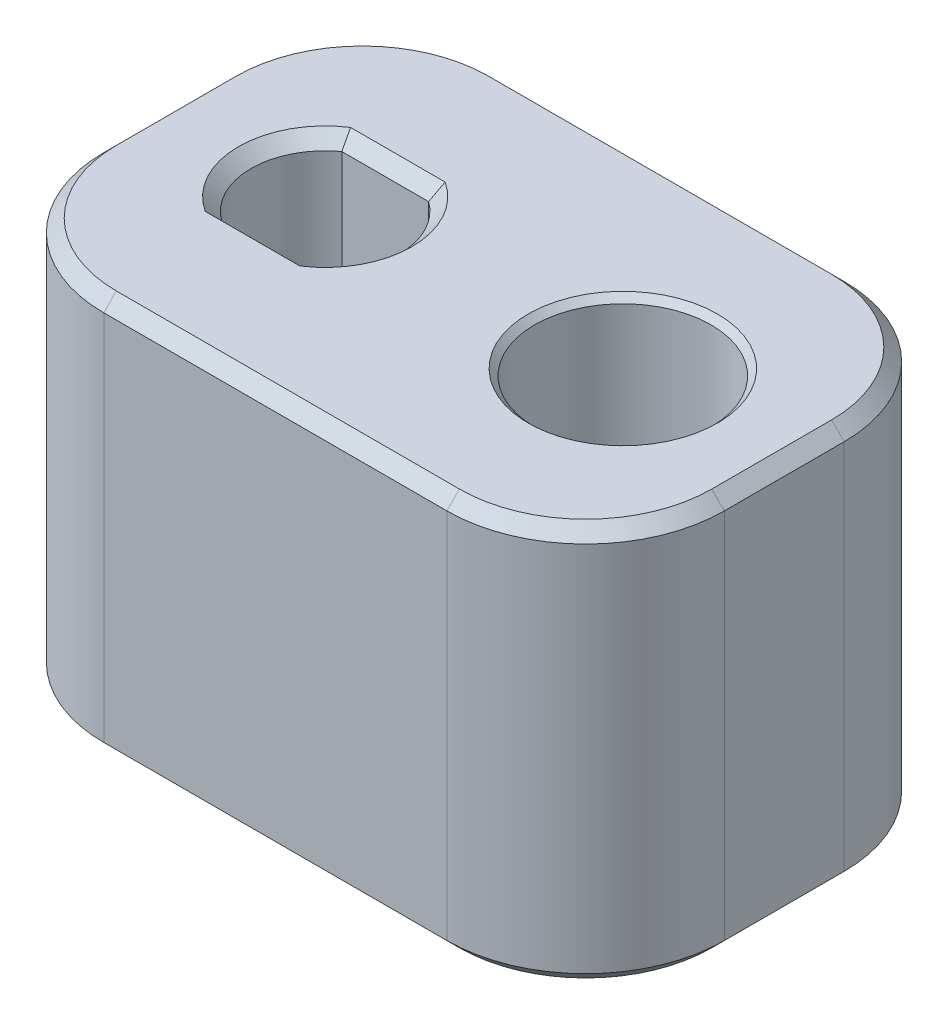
ISO-10303-21;
HEADER;
FILE_DESCRIPTION(('STEP AP214'),'2;1');
FILE_NAME('part.step','',(''),(''),'','','');
FILE_SCHEMA(('AUTOMOTIVE_DESIGN { 1 0 10303 214 1 1 1 1 }'));
ENDSEC;
DATA;
#1=APPLICATION_CONTEXT('core data for automotive mechanical design processes');
#2=APPLICATION_PROTOCOL_DEFINITION('international standard','automotive_design',2000,#1);
#3=PRODUCT_CONTEXT('',#1,'mechanical');
#4=PRODUCT('Part','Part','',(#3));
#5=PRODUCT_RELATED_PRODUCT_CATEGORY('part','',(#4));
#6=PRODUCT_DEFINITION_FORMATION('','',#4);
#7=PRODUCT_DEFINITION_CONTEXT('part definition',#1,'design');
#8=PRODUCT_DEFINITION('design','',#6,#7);
#9=PRODUCT_DEFINITION_SHAPE('','',#8);
#10=(LENGTH_UNIT() NAMED_UNIT(*) SI_UNIT(.MILLI.,.METRE.));
#11=(NAMED_UNIT(*) PLANE_ANGLE_UNIT() SI_UNIT($,.RADIAN.));
#12=(NAMED_UNIT(*) SI_UNIT($,.STERADIAN.) SOLID_ANGLE_UNIT());
#13=UNCERTAINTY_MEASURE_WITH_UNIT(LENGTH_MEASURE(1.E-05),#10,'distance_accuracy_value','');
#14=(GEOMETRIC_REPRESENTATION_CONTEXT(3) GLOBAL_UNCERTAINTY_ASSIGNED_CONTEXT((#13)) GLOBAL_UNIT_ASSIGNED_CONTEXT((#10,
#11,#12)) REPRESENTATION_CONTEXT('',''));
#15=CARTESIAN_POINT('',(0.,0.,0.));
#16=DIRECTION('',(0.,0.,1.));
#17=DIRECTION('',(1.,0.,0.));
#18=AXIS2_PLACEMENT_3D('',#15,#16,#17);
#19=CARTESIAN_POINT('',(12.4968,16.002,-8.001));
#20=DIRECTION('',(0.,-1.,0.));
#21=DIRECTION('',(0.,0.,-1.));
#22=AXIS2_PLACEMENT_3D('',#19,#20,#21);
#23=PLANE('',#22);
#24=CARTESIAN_POINT('',(6.9088,16.002,-2.413));
#25=DIRECTION('',(0.,-1.,0.));
#26=DIRECTION('',(0.,0.,-1.));
#27=AXIS2_PLACEMENT_3D('',#24,#25,#26);
#28=CIRCLE('',#27,5.08000000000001);
#29=CARTESIAN_POINT('',(11.9888,16.002,-2.413));
#30=VERTEX_POINT('',#29);
#31=CARTESIAN_POINT('',(6.9088,16.002,-7.493));
#32=VERTEX_POINT('',#31);
#33=EDGE_CURVE('E56',#30,#32,#28,.F.);
#34=ORIENTED_EDGE('',*,*,#33,.T.);
#35=DIRECTION('',(-1.,0.,0.));
#36=VECTOR('',#35,1.);
#37=CARTESIAN_POINT('',(12.4968,16.002,-7.493));
#38=LINE('',#37,#36);
#39=CARTESIAN_POINT('',(-6.9088,16.002,-7.493));
#40=VERTEX_POINT('',#39);
#41=EDGE_CURVE('E11',#32,#40,#38,.T.);
#42=ORIENTED_EDGE('',*,*,#41,.T.);
#43=CARTESIAN_POINT('',(-6.9088,16.002,-2.413));
#44=DIRECTION('',(0.,-1.,0.));
#45=DIRECTION('',(0.,0.,-1.));
#46=AXIS2_PLACEMENT_3D('',#43,#44,#45);
#47=CIRCLE('',#46,5.08000000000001);
#48=CARTESIAN_POINT('',(-11.9888,16.002,-2.413));
#49=VERTEX_POINT('',#48);
#50=EDGE_CURVE('E41',#40,#49,#47,.F.);
#51=ORIENTED_EDGE('',*,*,#50,.T.);
#52=DIRECTION('',(0.,0.,1.));
#53=VECTOR('',#52,1.);
#54=CARTESIAN_POINT('',(-11.9888,16.002,-8.001));
#55=LINE('',#54,#53);
#56=CARTESIAN_POINT('',(-11.9888,16.002,2.413));
#57=VERTEX_POINT('',#56);
#58=EDGE_CURVE('E402',#49,#57,#55,.T.);
#59=ORIENTED_EDGE('',*,*,#58,.T.);
#60=CARTESIAN_POINT('',(-6.9088,16.002,2.413));
#61=DIRECTION('',(0.,-1.,0.));
#62=DIRECTION('',(0.,0.,-1.));
#63=AXIS2_PLACEMENT_3D('',#60,#61,#62);
#64=CIRCLE('',#63,5.08000000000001);
#65=CARTESIAN_POINT('',(-6.9088,16.002,7.49300000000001));
#66=VERTEX_POINT('',#65);
#67=EDGE_CURVE('E398',#57,#66,#64,.F.);
#68=ORIENTED_EDGE('',*,*,#67,.T.);
#69=DIRECTION('',(1.,0.,0.));
#70=VECTOR('',#69,1.);
#71=CARTESIAN_POINT('',(12.4968,16.002,7.49300000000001));
#72=LINE('',#71,#70);
#73=CARTESIAN_POINT('',(6.9088,16.002,7.49300000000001));
#74=VERTEX_POINT('',#73);
#75=EDGE_CURVE('E394',#66,#74,#72,.T.);
#76=ORIENTED_EDGE('',*,*,#75,.T.);
#77=CARTESIAN_POINT('',(6.90879999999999,16.002,2.413));
#78=DIRECTION('',(0.,-1.,0.));
#79=DIRECTION('',(0.,0.,-1.));
#80=AXIS2_PLACEMENT_3D('',#77,#78,#79);
#81=CIRCLE('',#80,5.08000000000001);
#82=CARTESIAN_POINT('',(11.9888,16.002,2.413));
#83=VERTEX_POINT('',#82);
#84=EDGE_CURVE('E396',#74,#83,#81,.F.);
#85=ORIENTED_EDGE('',*,*,#84,.T.);
#86=DIRECTION('',(0.,0.,-1.));
#87=VECTOR('',#86,1.);
#88=CARTESIAN_POINT('',(11.9888,16.002,-8.001));
#89=LINE('',#88,#87);
#90=EDGE_CURVE('E400',#83,#30,#89,.T.);
#91=ORIENTED_EDGE('',*,*,#90,.T.);
#92=EDGE_LOOP('',(#34,#42,#51,#59,#68,#76,#85,#91));
#93=FACE_BOUND('',#92,.T.);
#94=DIRECTION('',(1.,0.,0.));
#95=VECTOR('',#94,1.);
#96=CARTESIAN_POINT('',(12.4968,16.002,-2.92735));
#97=LINE('',#96,#95);
#98=CARTESIAN_POINT('',(-7.8991777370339,16.002,-2.92735));
#99=VERTEX_POINT('',#98);
#100=CARTESIAN_POINT('',(-4.0896222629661,16.002,-2.92735));
#101=VERTEX_POINT('',#100);
#102=EDGE_CURVE('E237',#99,#101,#97,.T.);
#103=ORIENTED_EDGE('',*,*,#102,.T.);
#104=CARTESIAN_POINT('',(-5.9944,16.002,0.));
#105=DIRECTION('',(0.,-1.,0.));
#106=DIRECTION('',(0.,0.,-1.));
#107=AXIS2_PLACEMENT_3D('',#104,#105,#106);
#108=CIRCLE('',#107,3.4925);
#109=CARTESIAN_POINT('',(-4.08962226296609,16.002,2.92735));
#110=VERTEX_POINT('',#109);
#111=EDGE_CURVE('E249',#101,#110,#108,.T.);
#112=ORIENTED_EDGE('',*,*,#111,.T.);
#113=DIRECTION('',(-1.,0.,0.));
#114=VECTOR('',#113,1.);
#115=CARTESIAN_POINT('',(12.4968,16.002,2.92735));
#116=LINE('',#115,#114);
#117=CARTESIAN_POINT('',(-7.89917773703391,16.002,2.92735000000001));
#118=VERTEX_POINT('',#117);
#119=EDGE_CURVE('E247',#110,#118,#116,.T.);
#120=ORIENTED_EDGE('',*,*,#119,.T.);
#121=CARTESIAN_POINT('',(-5.9944,16.002,0.));
#122=DIRECTION('',(0.,-1.,0.));
#123=DIRECTION('',(0.,0.,-1.));
#124=AXIS2_PLACEMENT_3D('',#121,#122,#123);
#125=CIRCLE('',#124,3.49250000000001);
#126=EDGE_CURVE('E245',#118,#99,#125,.T.);
#127=ORIENTED_EDGE('',*,*,#126,.T.);
#128=EDGE_LOOP('',(#103,#112,#120,#127));
#129=FACE_BOUND('',#128,.T.);
#130=CARTESIAN_POINT('',(5.9944,16.002,0.));
#131=DIRECTION('',(0.,-1.,0.));
#132=DIRECTION('',(0.,0.,-1.));
#133=AXIS2_PLACEMENT_3D('',#130,#131,#132);
#134=CIRCLE('',#133,3.81);
#135=CARTESIAN_POINT('',(5.9944,16.002,-3.81));
#136=VERTEX_POINT('',#135);
#137=EDGE_CURVE('E493',#136,#136,#134,.T.);
#138=ORIENTED_EDGE('',*,*,#137,.T.);
#139=EDGE_LOOP('',(#138));
#140=FACE_BOUND('',#139,.T.);
#141=ADVANCED_FACE('F32',(#93,#129,#140),#23,.F.);
#142=CARTESIAN_POINT('',(12.4968,0.,-8.001));
#143=DIRECTION('',(0.,-1.,0.));
#144=DIRECTION('',(0.,0.,-1.));
#145=AXIS2_PLACEMENT_3D('',#142,#143,#144);
#146=PLANE('',#145);
#147=CARTESIAN_POINT('',(-6.9088,0.,-2.413));
#148=DIRECTION('',(0.,-1.,0.));
#149=DIRECTION('',(0.,0.,-1.));
#150=AXIS2_PLACEMENT_3D('',#147,#148,#149);
#151=CIRCLE('',#150,5.08);
#152=CARTESIAN_POINT('',(-11.9888,0.,-2.413));
#153=VERTEX_POINT('',#152);
#154=CARTESIAN_POINT('',(-6.9088,0.,-7.493));
#155=VERTEX_POINT('',#154);
#156=EDGE_CURVE('E361',#153,#155,#151,.T.);
#157=ORIENTED_EDGE('',*,*,#156,.T.);
#158=DIRECTION('',(1.,0.,0.));
#159=VECTOR('',#158,1.);
#160=CARTESIAN_POINT('',(6.9088,0.,-7.493));
#161=LINE('',#160,#159);
#162=CARTESIAN_POINT('',(6.9088,0.,-7.493));
#163=VERTEX_POINT('',#162);
#164=EDGE_CURVE('E363',#155,#163,#161,.T.);
#165=ORIENTED_EDGE('',*,*,#164,.T.);
#166=CARTESIAN_POINT('',(6.9088,0.,-2.413));
#167=DIRECTION('',(0.,-1.,0.));
#168=DIRECTION('',(0.,0.,-1.));
#169=AXIS2_PLACEMENT_3D('',#166,#167,#168);
#170=CIRCLE('',#169,5.08);
#171=CARTESIAN_POINT('',(11.9888,0.,-2.413));
#172=VERTEX_POINT('',#171);
#173=EDGE_CURVE('E359',#163,#172,#170,.T.);
#174=ORIENTED_EDGE('',*,*,#173,.T.);
#175=DIRECTION('',(0.,0.,1.));
#176=VECTOR('',#175,1.);
#177=CARTESIAN_POINT('',(11.9888,0.,2.413));
#178=LINE('',#177,#176);
#179=CARTESIAN_POINT('',(11.9888,0.,2.413));
#180=VERTEX_POINT('',#179);
#181=EDGE_CURVE('E355',#172,#180,#178,.T.);
#182=ORIENTED_EDGE('',*,*,#181,.T.);
#183=CARTESIAN_POINT('',(6.90879999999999,0.,2.413));
#184=DIRECTION('',(0.,-1.,0.));
#185=DIRECTION('',(0.,0.,-1.));
#186=AXIS2_PLACEMENT_3D('',#183,#184,#185);
#187=CIRCLE('',#186,5.08);
#188=CARTESIAN_POINT('',(6.9088,0.,7.493));
#189=VERTEX_POINT('',#188);
#190=EDGE_CURVE('E351',#180,#189,#187,.T.);
#191=ORIENTED_EDGE('',*,*,#190,.T.);
#192=DIRECTION('',(-1.,0.,0.));
#193=VECTOR('',#192,1.);
#194=CARTESIAN_POINT('',(-6.9088,0.,7.493));
#195=LINE('',#194,#193);
#196=CARTESIAN_POINT('',(-6.9088,0.,7.493));
#197=VERTEX_POINT('',#196);
#198=EDGE_CURVE('E349',#189,#197,#195,.T.);
#199=ORIENTED_EDGE('',*,*,#198,.T.);
#200=CARTESIAN_POINT('',(-6.9088,0.,2.413));
#201=DIRECTION('',(0.,-1.,0.));
#202=DIRECTION('',(0.,0.,-1.));
#203=AXIS2_PLACEMENT_3D('',#200,#201,#202);
#204=CIRCLE('',#203,5.08);
#205=CARTESIAN_POINT('',(-11.9888,0.,2.413));
#206=VERTEX_POINT('',#205);
#207=EDGE_CURVE('E353',#197,#206,#204,.T.);
#208=ORIENTED_EDGE('',*,*,#207,.T.);
#209=DIRECTION('',(0.,0.,-1.));
#210=VECTOR('',#209,1.);
#211=CARTESIAN_POINT('',(-11.9888,0.,-2.413));
#212=LINE('',#211,#210);
#213=EDGE_CURVE('E357',#206,#153,#212,.T.);
#214=ORIENTED_EDGE('',*,*,#213,.T.);
#215=EDGE_LOOP('',(#157,#165,#174,#182,#191,#199,#208,#214));
#216=FACE_BOUND('',#215,.T.);
#217=CARTESIAN_POINT('',(-5.9944,0.,0.));
#218=DIRECTION('',(0.,-1.,0.));
#219=DIRECTION('',(0.,0.,-1.));
#220=AXIS2_PLACEMENT_3D('',#217,#218,#219);
#221=CIRCLE('',#220,3.4925);
#222=CARTESIAN_POINT('',(-7.8991777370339,0.,-2.92735));
#223=VERTEX_POINT('',#222);
#224=CARTESIAN_POINT('',(-7.8991777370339,0.,2.92735));
#225=VERTEX_POINT('',#224);
#226=EDGE_CURVE('E262',#223,#225,#221,.F.);
#227=ORIENTED_EDGE('',*,*,#226,.T.);
#228=DIRECTION('',(1.,0.,0.));
#229=VECTOR('',#228,1.);
#230=CARTESIAN_POINT('',(-4.24683431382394,0.,2.92735));
#231=LINE('',#230,#229);
#232=CARTESIAN_POINT('',(-4.0896222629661,0.,2.92735));
#233=VERTEX_POINT('',#232);
#234=EDGE_CURVE('E266',#225,#233,#231,.T.);
#235=ORIENTED_EDGE('',*,*,#234,.T.);
#236=CARTESIAN_POINT('',(-5.9944,0.,0.));
#237=DIRECTION('',(0.,-1.,0.));
#238=DIRECTION('',(0.,0.,-1.));
#239=AXIS2_PLACEMENT_3D('',#236,#237,#238);
#240=CIRCLE('',#239,3.4925);
#241=CARTESIAN_POINT('',(-4.0896222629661,0.,-2.92735));
#242=VERTEX_POINT('',#241);
#243=EDGE_CURVE('E264',#233,#242,#240,.F.);
#244=ORIENTED_EDGE('',*,*,#243,.T.);
#245=DIRECTION('',(-1.,0.,0.));
#246=VECTOR('',#245,1.);
#247=CARTESIAN_POINT('',(-7.74196568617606,0.,-2.92735));
#248=LINE('',#247,#246);
#249=EDGE_CURVE('E226',#242,#223,#248,.T.);
#250=ORIENTED_EDGE('',*,*,#249,.T.);
#251=EDGE_LOOP('',(#227,#235,#244,#250));
#252=FACE_BOUND('',#251,.T.);
#253=CARTESIAN_POINT('',(5.9944,0.,0.));
#254=DIRECTION('',(0.,-1.,0.));
#255=DIRECTION('',(0.,0.,-1.));
#256=AXIS2_PLACEMENT_3D('',#253,#254,#255);
#257=CIRCLE('',#256,5.6642);
#258=CARTESIAN_POINT('',(5.9944,0.,-5.6642));
#259=VERTEX_POINT('',#258);
#260=EDGE_CURVE('E428',#259,#259,#257,.T.);
#261=ORIENTED_EDGE('',*,*,#260,.F.);
#262=EDGE_LOOP('',(#261));
#263=FACE_BOUND('',#262,.T.);
#264=ADVANCED_FACE('F514',(#216,#252,#263),#146,.T.);
#265=CARTESIAN_POINT('',(12.4968,16.002,8.001));
#266=DIRECTION('',(-1.,0.,0.));
#267=DIRECTION('',(0.,0.,1.));
#268=AXIS2_PLACEMENT_3D('',#265,#266,#267);
#269=PLANE('',#268);
#270=DIRECTION('',(0.,-1.,0.));
#271=VECTOR('',#270,1.);
#272=CARTESIAN_POINT('',(12.4968,16.002,2.413));
#273=LINE('',#272,#271);
#274=CARTESIAN_POINT('',(12.4968,15.494,2.413));
#275=VERTEX_POINT('',#274);
#276=CARTESIAN_POINT('',(12.4968,0.507999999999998,2.413));
#277=VERTEX_POINT('',#276);
#278=EDGE_CURVE('E240',#275,#277,#273,.T.);
#279=ORIENTED_EDGE('',*,*,#278,.T.);
#280=DIRECTION('',(0.,0.,-1.));
#281=VECTOR('',#280,1.);
#282=CARTESIAN_POINT('',(12.4968,0.507999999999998,-2.413));
#283=LINE('',#282,#281);
#284=CARTESIAN_POINT('',(12.4968,0.507999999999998,-2.413));
#285=VERTEX_POINT('',#284);
#286=EDGE_CURVE('E380',#277,#285,#283,.T.);
#287=ORIENTED_EDGE('',*,*,#286,.T.);
#288=DIRECTION('',(0.,-1.,0.));
#289=VECTOR('',#288,1.);
#290=CARTESIAN_POINT('',(12.4968,16.002,-2.413));
#291=LINE('',#290,#289);
#292=CARTESIAN_POINT('',(12.4968,15.494,-2.413));
#293=VERTEX_POINT('',#292);
#294=EDGE_CURVE('E235',#285,#293,#291,.F.);
#295=ORIENTED_EDGE('',*,*,#294,.T.);
#296=DIRECTION('',(0.,0.,1.));
#297=VECTOR('',#296,1.);
#298=CARTESIAN_POINT('',(12.4968,15.494,8.001));
#299=LINE('',#298,#297);
#300=EDGE_CURVE('E378',#293,#275,#299,.T.);
#301=ORIENTED_EDGE('',*,*,#300,.T.);
#302=EDGE_LOOP('',(#279,#287,#295,#301));
#303=FACE_BOUND('',#302,.T.);
#304=ADVANCED_FACE('F516',(#303),#269,.F.);
#305=CARTESIAN_POINT('',(-12.4968,16.002,-8.001));
#306=DIRECTION('',(0.,0.,1.));
#307=DIRECTION('',(1.,0.,0.));
#308=AXIS2_PLACEMENT_3D('',#305,#306,#307);
#309=PLANE('',#308);
#310=DIRECTION('',(0.,-1.,0.));
#311=VECTOR('',#310,1.);
#312=CARTESIAN_POINT('',(6.9088,16.002,-8.001));
#313=LINE('',#312,#311);
#314=CARTESIAN_POINT('',(6.9088,15.494,-8.001));
#315=VERTEX_POINT('',#314);
#316=CARTESIAN_POINT('',(6.9088,0.507999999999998,-8.001));
#317=VERTEX_POINT('',#316);
#318=EDGE_CURVE('E480',#315,#317,#313,.T.);
#319=ORIENTED_EDGE('',*,*,#318,.T.);
#320=DIRECTION('',(-1.,0.,0.));
#321=VECTOR('',#320,1.);
#322=CARTESIAN_POINT('',(-6.9088,0.507999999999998,-8.001));
#323=LINE('',#322,#321);
#324=CARTESIAN_POINT('',(-6.9088,0.507999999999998,-8.001));
#325=VERTEX_POINT('',#324);
#326=EDGE_CURVE('E346',#317,#325,#323,.T.);
#327=ORIENTED_EDGE('',*,*,#326,.T.);
#328=DIRECTION('',(0.,-1.,0.));
#329=VECTOR('',#328,1.);
#330=CARTESIAN_POINT('',(-6.9088,16.002,-8.001));
#331=LINE('',#330,#329);
#332=CARTESIAN_POINT('',(-6.9088,15.494,-8.001));
#333=VERTEX_POINT('',#332);
#334=EDGE_CURVE('E475',#325,#333,#331,.F.);
#335=ORIENTED_EDGE('',*,*,#334,.T.);
#336=DIRECTION('',(1.,0.,0.));
#337=VECTOR('',#336,1.);
#338=CARTESIAN_POINT('',(-12.4968,15.494,-8.001));
#339=LINE('',#338,#337);
#340=EDGE_CURVE('E269',#333,#315,#339,.T.);
#341=ORIENTED_EDGE('',*,*,#340,.T.);
#342=EDGE_LOOP('',(#319,#327,#335,#341));
#343=FACE_BOUND('',#342,.T.);
#344=ADVANCED_FACE('F523',(#343),#309,.F.);
#345=CARTESIAN_POINT('',(-12.4968,16.002,8.001));
#346=DIRECTION('',(1.,0.,0.));
#347=DIRECTION('',(0.,0.,-1.));
#348=AXIS2_PLACEMENT_3D('',#345,#346,#347);
#349=PLANE('',#348);
#350=DIRECTION('',(0.,-1.,0.));
#351=VECTOR('',#350,1.);
#352=CARTESIAN_POINT('',(-12.4968,16.002,-2.413));
#353=LINE('',#352,#351);
#354=CARTESIAN_POINT('',(-12.4968,15.494,-2.413));
#355=VERTEX_POINT('',#354);
#356=CARTESIAN_POINT('',(-12.4968,0.507999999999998,-2.413));
#357=VERTEX_POINT('',#356);
#358=EDGE_CURVE('E483',#355,#357,#353,.T.);
#359=ORIENTED_EDGE('',*,*,#358,.T.);
#360=DIRECTION('',(0.,0.,1.));
#361=VECTOR('',#360,1.);
#362=CARTESIAN_POINT('',(-12.4968,0.507999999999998,2.413));
#363=LINE('',#362,#361);
#364=CARTESIAN_POINT('',(-12.4968,0.507999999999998,2.413));
#365=VERTEX_POINT('',#364);
#366=EDGE_CURVE('E376',#357,#365,#363,.T.);
#367=ORIENTED_EDGE('',*,*,#366,.T.);
#368=DIRECTION('',(0.,-1.,0.));
#369=VECTOR('',#368,1.);
#370=CARTESIAN_POINT('',(-12.4968,16.002,2.413));
#371=LINE('',#370,#369);
#372=CARTESIAN_POINT('',(-12.4968,15.494,2.413));
#373=VERTEX_POINT('',#372);
#374=EDGE_CURVE('E486',#365,#373,#371,.F.);
#375=ORIENTED_EDGE('',*,*,#374,.T.);
#376=DIRECTION('',(0.,0.,-1.));
#377=VECTOR('',#376,1.);
#378=CARTESIAN_POINT('',(-12.4968,15.494,8.001));
#379=LINE('',#378,#377);
#380=EDGE_CURVE('E374',#373,#355,#379,.T.);
#381=ORIENTED_EDGE('',*,*,#380,.T.);
#382=EDGE_LOOP('',(#359,#367,#375,#381));
#383=FACE_BOUND('',#382,.T.);
#384=ADVANCED_FACE('F533',(#383),#349,.F.);
#385=CARTESIAN_POINT('',(-12.4968,16.002,8.001));
#386=DIRECTION('',(0.,0.,-1.));
#387=DIRECTION('',(-1.,0.,0.));
#388=AXIS2_PLACEMENT_3D('',#385,#386,#387);
#389=PLANE('',#388);
#390=DIRECTION('',(0.,-1.,0.));
#391=VECTOR('',#390,1.);
#392=CARTESIAN_POINT('',(-6.9088,16.002,8.001));
#393=LINE('',#392,#391);
#394=CARTESIAN_POINT('',(-6.9088,15.494,8.001));
#395=VERTEX_POINT('',#394);
#396=CARTESIAN_POINT('',(-6.9088,0.507999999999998,8.001));
#397=VERTEX_POINT('',#396);
#398=EDGE_CURVE('E464',#395,#397,#393,.T.);
#399=ORIENTED_EDGE('',*,*,#398,.T.);
#400=DIRECTION('',(1.,0.,0.));
#401=VECTOR('',#400,1.);
#402=CARTESIAN_POINT('',(6.9088,0.507999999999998,8.001));
#403=LINE('',#402,#401);
#404=CARTESIAN_POINT('',(6.9088,0.507999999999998,8.001));
#405=VERTEX_POINT('',#404);
#406=EDGE_CURVE('E392',#397,#405,#403,.T.);
#407=ORIENTED_EDGE('',*,*,#406,.T.);
#408=DIRECTION('',(0.,-1.,0.));
#409=VECTOR('',#408,1.);
#410=CARTESIAN_POINT('',(6.9088,16.002,8.001));
#411=LINE('',#410,#409);
#412=CARTESIAN_POINT('',(6.9088,15.494,8.001));
#413=VERTEX_POINT('',#412);
#414=EDGE_CURVE('E467',#405,#413,#411,.F.);
#415=ORIENTED_EDGE('',*,*,#414,.T.);
#416=DIRECTION('',(-1.,0.,0.));
#417=VECTOR('',#416,1.);
#418=CARTESIAN_POINT('',(-12.4968,15.494,8.001));
#419=LINE('',#418,#417);
#420=EDGE_CURVE('E390',#413,#395,#419,.T.);
#421=ORIENTED_EDGE('',*,*,#420,.T.);
#422=EDGE_LOOP('',(#399,#407,#415,#421));
#423=FACE_BOUND('',#422,.T.);
#424=ADVANCED_FACE('F463',(#423),#389,.F.);
#425=CARTESIAN_POINT('',(-6.9088,16.002,-2.413));
#426=DIRECTION('',(0.,-1.,0.));
#427=DIRECTION('',(0.,0.,-1.));
#428=AXIS2_PLACEMENT_3D('',#425,#426,#427);
#429=CYLINDRICAL_SURFACE('',#428,5.588);
#430=ORIENTED_EDGE('',*,*,#334,.F.);
#431=CARTESIAN_POINT('',(-6.9088,0.507999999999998,-2.413));
#432=DIRECTION('',(0.,-1.,0.));
#433=DIRECTION('',(0.,0.,-1.));
#434=AXIS2_PLACEMENT_3D('',#431,#432,#433);
#435=CIRCLE('',#434,5.588);
#436=EDGE_CURVE('E368',#325,#357,#435,.F.);
#437=ORIENTED_EDGE('',*,*,#436,.T.);
#438=ORIENTED_EDGE('',*,*,#358,.F.);
#439=CARTESIAN_POINT('',(-6.9088,15.494,-2.413));
#440=DIRECTION('',(0.,-1.,0.));
#441=DIRECTION('',(0.,0.,-1.));
#442=AXIS2_PLACEMENT_3D('',#439,#440,#441);
#443=CIRCLE('',#442,5.588);
#444=EDGE_CURVE('E366',#355,#333,#443,.T.);
#445=ORIENTED_EDGE('',*,*,#444,.T.);
#446=EDGE_LOOP('',(#430,#437,#438,#445));
#447=FACE_BOUND('',#446,.T.);
#448=ADVANCED_FACE('F532',(#447),#429,.T.);
#449=CARTESIAN_POINT('',(-6.9088,16.002,2.413));
#450=DIRECTION('',(0.,-1.,0.));
#451=DIRECTION('',(0.,0.,-1.));
#452=AXIS2_PLACEMENT_3D('',#449,#450,#451);
#453=CYLINDRICAL_SURFACE('',#452,5.588);
#454=ORIENTED_EDGE('',*,*,#374,.F.);
#455=CARTESIAN_POINT('',(-6.9088,0.507999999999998,2.413));
#456=DIRECTION('',(0.,-1.,0.));
#457=DIRECTION('',(0.,0.,-1.));
#458=AXIS2_PLACEMENT_3D('',#455,#456,#457);
#459=CIRCLE('',#458,5.588);
#460=EDGE_CURVE('E384',#365,#397,#459,.F.);
#461=ORIENTED_EDGE('',*,*,#460,.T.);
#462=ORIENTED_EDGE('',*,*,#398,.F.);
#463=CARTESIAN_POINT('',(-6.9088,15.494,2.413));
#464=DIRECTION('',(0.,-1.,0.));
#465=DIRECTION('',(0.,0.,-1.));
#466=AXIS2_PLACEMENT_3D('',#463,#464,#465);
#467=CIRCLE('',#466,5.588);
#468=EDGE_CURVE('E382',#395,#373,#467,.T.);
#469=ORIENTED_EDGE('',*,*,#468,.T.);
#470=EDGE_LOOP('',(#454,#461,#462,#469));
#471=FACE_BOUND('',#470,.T.);
#472=ADVANCED_FACE('F470',(#471),#453,.T.);
#473=CARTESIAN_POINT('',(6.9088,16.002,-2.413));
#474=DIRECTION('',(0.,-1.,0.));
#475=DIRECTION('',(0.,0.,-1.));
#476=AXIS2_PLACEMENT_3D('',#473,#474,#475);
#477=CYLINDRICAL_SURFACE('',#476,5.588);
#478=ORIENTED_EDGE('',*,*,#294,.F.);
#479=CARTESIAN_POINT('',(6.9088,0.507999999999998,-2.413));
#480=DIRECTION('',(0.,-1.,0.));
#481=DIRECTION('',(0.,0.,-1.));
#482=AXIS2_PLACEMENT_3D('',#479,#480,#481);
#483=CIRCLE('',#482,5.588);
#484=EDGE_CURVE('E372',#285,#317,#483,.F.);
#485=ORIENTED_EDGE('',*,*,#484,.T.);
#486=ORIENTED_EDGE('',*,*,#318,.F.);
#487=CARTESIAN_POINT('',(6.9088,15.494,-2.413));
#488=DIRECTION('',(0.,-1.,0.));
#489=DIRECTION('',(0.,0.,-1.));
#490=AXIS2_PLACEMENT_3D('',#487,#488,#489);
#491=CIRCLE('',#490,5.588);
#492=EDGE_CURVE('E370',#315,#293,#491,.T.);
#493=ORIENTED_EDGE('',*,*,#492,.T.);
#494=EDGE_LOOP('',(#478,#485,#486,#493));
#495=FACE_BOUND('',#494,.T.);
#496=ADVANCED_FACE('F545',(#495),#477,.T.);
#497=CARTESIAN_POINT('',(6.90879999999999,16.002,2.413));
#498=DIRECTION('',(0.,-1.,0.));
#499=DIRECTION('',(0.,0.,-1.));
#500=AXIS2_PLACEMENT_3D('',#497,#498,#499);
#501=CYLINDRICAL_SURFACE('',#500,5.588);
#502=ORIENTED_EDGE('',*,*,#414,.F.);
#503=CARTESIAN_POINT('',(6.90879999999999,0.507999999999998,2.413));
#504=DIRECTION('',(0.,-1.,0.));
#505=DIRECTION('',(0.,0.,-1.));
#506=AXIS2_PLACEMENT_3D('',#503,#504,#505);
#507=CIRCLE('',#506,5.588);
#508=EDGE_CURVE('E388',#405,#277,#507,.F.);
#509=ORIENTED_EDGE('',*,*,#508,.T.);
#510=ORIENTED_EDGE('',*,*,#278,.F.);
#511=CARTESIAN_POINT('',(6.90879999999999,15.494,2.413));
#512=DIRECTION('',(0.,-1.,0.));
#513=DIRECTION('',(0.,0.,-1.));
#514=AXIS2_PLACEMENT_3D('',#511,#512,#513);
#515=CIRCLE('',#514,5.588);
#516=EDGE_CURVE('E386',#275,#413,#515,.T.);
#517=ORIENTED_EDGE('',*,*,#516,.T.);
#518=EDGE_LOOP('',(#502,#509,#510,#517));
#519=FACE_BOUND('',#518,.T.);
#520=ADVANCED_FACE('F547',(#519),#501,.T.);
#521=CARTESIAN_POINT('',(-5.9944,0.,0.));
#522=DIRECTION('',(0.,1.,0.));
#523=DIRECTION('',(0.,0.,1.));
#524=AXIS2_PLACEMENT_3D('',#521,#522,#523);
#525=CYLINDRICAL_SURFACE('',#524,2.9845);
#526=DIRECTION('',(0.,1.,0.));
#527=VECTOR('',#526,1.);
#528=CARTESIAN_POINT('',(-7.74196568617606,0.,-2.41935));
#529=LINE('',#528,#527);
#530=CARTESIAN_POINT('',(-7.74196568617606,0.508000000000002,-2.41935));
#531=VERTEX_POINT('',#530);
#532=CARTESIAN_POINT('',(-7.74196568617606,15.494,-2.41935));
#533=VERTEX_POINT('',#532);
#534=EDGE_CURVE('E203',#531,#533,#529,.T.);
#535=ORIENTED_EDGE('',*,*,#534,.T.);
#536=CARTESIAN_POINT('',(-5.9944,15.494,0.));
#537=DIRECTION('',(0.,-1.,0.));
#538=DIRECTION('',(0.,0.,-1.));
#539=AXIS2_PLACEMENT_3D('',#536,#537,#538);
#540=CIRCLE('',#539,2.9845);
#541=CARTESIAN_POINT('',(-7.74196568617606,15.494,2.41935));
#542=VERTEX_POINT('',#541);
#543=EDGE_CURVE('E209',#533,#542,#540,.F.);
#544=ORIENTED_EDGE('',*,*,#543,.T.);
#545=DIRECTION('',(0.,1.,0.));
#546=VECTOR('',#545,1.);
#547=CARTESIAN_POINT('',(-7.74196568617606,0.,2.41935));
#548=LINE('',#547,#546);
#549=CARTESIAN_POINT('',(-7.74196568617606,0.508000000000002,2.41935));
#550=VERTEX_POINT('',#549);
#551=EDGE_CURVE('E488',#550,#542,#548,.T.);
#552=ORIENTED_EDGE('',*,*,#551,.F.);
#553=CARTESIAN_POINT('',(-5.9944,0.508000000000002,0.));
#554=DIRECTION('',(0.,-1.,0.));
#555=DIRECTION('',(0.,0.,-1.));
#556=AXIS2_PLACEMENT_3D('',#553,#554,#555);
#557=CIRCLE('',#556,2.9845);
#558=EDGE_CURVE('E257',#550,#531,#557,.T.);
#559=ORIENTED_EDGE('',*,*,#558,.T.);
#560=EDGE_LOOP('',(#535,#544,#552,#559));
#561=FACE_BOUND('',#560,.T.);
#562=ADVANCED_FACE('F550',(#561),#525,.F.);
#563=CARTESIAN_POINT('',(-7.74196568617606,0.,-2.41935));
#564=DIRECTION('',(0.,0.,-1.));
#565=DIRECTION('',(-1.,0.,0.));
#566=AXIS2_PLACEMENT_3D('',#563,#564,#565);
#567=PLANE('',#566);
#568=DIRECTION('',(0.,1.,0.));
#569=VECTOR('',#568,1.);
#570=CARTESIAN_POINT('',(-4.24683431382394,0.,-2.41935));
#571=LINE('',#570,#569);
#572=CARTESIAN_POINT('',(-4.24683431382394,0.508000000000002,-2.41935));
#573=VERTEX_POINT('',#572);
#574=CARTESIAN_POINT('',(-4.24683431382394,15.494,-2.41935));
#575=VERTEX_POINT('',#574);
#576=EDGE_CURVE('E201',#573,#575,#571,.T.);
#577=ORIENTED_EDGE('',*,*,#576,.T.);
#578=DIRECTION('',(-1.,0.,0.));
#579=VECTOR('',#578,1.);
#580=CARTESIAN_POINT('',(-7.74196568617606,15.494,-2.41935));
#581=LINE('',#580,#579);
#582=EDGE_CURVE('E208',#575,#533,#581,.T.);
#583=ORIENTED_EDGE('',*,*,#582,.T.);
#584=ORIENTED_EDGE('',*,*,#534,.F.);
#585=DIRECTION('',(1.,0.,0.));
#586=VECTOR('',#585,1.);
#587=CARTESIAN_POINT('',(-4.24683431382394,0.508000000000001,-2.41935));
#588=LINE('',#587,#586);
#589=EDGE_CURVE('E198',#531,#573,#588,.T.);
#590=ORIENTED_EDGE('',*,*,#589,.T.);
#591=EDGE_LOOP('',(#577,#583,#584,#590));
#592=FACE_BOUND('',#591,.T.);
#593=ADVANCED_FACE('F200',(#592),#567,.F.);
#594=CARTESIAN_POINT('',(-5.9944,0.,0.));
#595=DIRECTION('',(0.,1.,0.));
#596=DIRECTION('',(0.,0.,1.));
#597=AXIS2_PLACEMENT_3D('',#594,#595,#596);
#598=CYLINDRICAL_SURFACE('',#597,2.9845);
#599=DIRECTION('',(0.,1.,0.));
#600=VECTOR('',#599,1.);
#601=CARTESIAN_POINT('',(-4.24683431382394,0.,2.41935));
#602=LINE('',#601,#600);
#603=CARTESIAN_POINT('',(-4.24683431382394,0.508000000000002,2.41935));
#604=VERTEX_POINT('',#603);
#605=CARTESIAN_POINT('',(-4.24683431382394,15.494,2.41935));
#606=VERTEX_POINT('',#605);
#607=EDGE_CURVE('E220',#604,#606,#602,.T.);
#608=ORIENTED_EDGE('',*,*,#607,.T.);
#609=CARTESIAN_POINT('',(-5.9944,15.494,0.));
#610=DIRECTION('',(0.,-1.,0.));
#611=DIRECTION('',(0.,0.,-1.));
#612=AXIS2_PLACEMENT_3D('',#609,#610,#611);
#613=CIRCLE('',#612,2.9845);
#614=EDGE_CURVE('E219',#606,#575,#613,.F.);
#615=ORIENTED_EDGE('',*,*,#614,.T.);
#616=ORIENTED_EDGE('',*,*,#576,.F.);
#617=CARTESIAN_POINT('',(-5.9944,0.508000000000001,0.));
#618=DIRECTION('',(0.,-1.,0.));
#619=DIRECTION('',(0.,0.,-1.));
#620=AXIS2_PLACEMENT_3D('',#617,#618,#619);
#621=CIRCLE('',#620,2.9845);
#622=EDGE_CURVE('E216',#573,#604,#621,.T.);
#623=ORIENTED_EDGE('',*,*,#622,.T.);
#624=EDGE_LOOP('',(#608,#615,#616,#623));
#625=FACE_BOUND('',#624,.T.);
#626=ADVANCED_FACE('F214',(#625),#598,.F.);
#627=CARTESIAN_POINT('',(-7.74196568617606,0.,2.41935));
#628=DIRECTION('',(0.,0.,1.));
#629=DIRECTION('',(1.,0.,0.));
#630=AXIS2_PLACEMENT_3D('',#627,#628,#629);
#631=PLANE('',#630);
#632=ORIENTED_EDGE('',*,*,#551,.T.);
#633=DIRECTION('',(1.,0.,0.));
#634=VECTOR('',#633,1.);
#635=CARTESIAN_POINT('',(-7.74196568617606,15.494,2.41935));
#636=LINE('',#635,#634);
#637=EDGE_CURVE('E255',#542,#606,#636,.T.);
#638=ORIENTED_EDGE('',*,*,#637,.T.);
#639=ORIENTED_EDGE('',*,*,#607,.F.);
#640=DIRECTION('',(-1.,0.,0.));
#641=VECTOR('',#640,1.);
#642=CARTESIAN_POINT('',(-7.74196568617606,0.508000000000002,2.41935));
#643=LINE('',#642,#641);
#644=EDGE_CURVE('E252',#604,#550,#643,.T.);
#645=ORIENTED_EDGE('',*,*,#644,.T.);
#646=EDGE_LOOP('',(#632,#638,#639,#645));
#647=FACE_BOUND('',#646,.T.);
#648=ADVANCED_FACE('F309',(#647),#631,.F.);
#649=CARTESIAN_POINT('',(-5.9944,15.494,0.));
#650=DIRECTION('',(0.,1.,0.));
#651=DIRECTION('',(0.,0.,1.));
#652=AXIS2_PLACEMENT_3D('',#649,#650,#651);
#653=CONICAL_SURFACE('',#652,2.9845,0.785398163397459);
#654=CARTESIAN_POINT('',(-7.8991777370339,16.002,-2.92735));
#655=CARTESIAN_POINT('',(-7.87405161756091,15.917166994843,-2.84251699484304));
#656=CARTESIAN_POINT('',(-7.84838757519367,15.8324172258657,-2.75776722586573));
#657=CARTESIAN_POINT('',(-7.79598356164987,15.6630838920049,-2.58843389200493));
#658=CARTESIAN_POINT('',(-7.7692435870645,15.5785003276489,-2.50385032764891));
#659=CARTESIAN_POINT('',(-7.74196568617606,15.494,-2.41935));
#660=B_SPLINE_CURVE_WITH_KNOTS('',3,(#654,#655,#656,#657,#658,#659),.UNSPECIFIED.,.F.,.F.,(4,2,
4),(0.,0.367713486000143,0.735428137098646),.UNSPECIFIED.);
#661=EDGE_CURVE('E294',#99,#533,#660,.T.);
#662=ORIENTED_EDGE('',*,*,#661,.F.);
#663=ORIENTED_EDGE('',*,*,#126,.F.);
#664=CARTESIAN_POINT('',(-7.89917773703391,16.002,2.92735000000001));
#665=CARTESIAN_POINT('',(-7.87405161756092,15.917166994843,2.84251699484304));
#666=CARTESIAN_POINT('',(-7.84838757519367,15.8324172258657,2.75776722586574));
#667=CARTESIAN_POINT('',(-7.79598356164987,15.6630838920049,2.58843389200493));
#668=CARTESIAN_POINT('',(-7.7692435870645,15.5785003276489,2.50385032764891));
#669=CARTESIAN_POINT('',(-7.74196568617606,15.494,2.41935));
#670=B_SPLINE_CURVE_WITH_KNOTS('',3,(#664,#665,#666,#667,#668,#669),.UNSPECIFIED.,.F.,.F.,(4,2,
4),(0.,0.367713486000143,0.735428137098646),.UNSPECIFIED.);
#671=EDGE_CURVE('E300',#542,#118,#670,.F.);
#672=ORIENTED_EDGE('',*,*,#671,.F.);
#673=ORIENTED_EDGE('',*,*,#543,.F.);
#674=EDGE_LOOP('',(#662,#663,#672,#673));
#675=FACE_BOUND('',#674,.T.);
#676=ADVANCED_FACE('F305',(#675),#653,.F.);
#677=CARTESIAN_POINT('',(-7.74196568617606,15.494,2.41935));
#678=DIRECTION('',(0.,-0.707106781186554,0.707106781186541));
#679=DIRECTION('',(0.,-0.707106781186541,-0.707106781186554));
#680=AXIS2_PLACEMENT_3D('',#677,#678,#679);
#681=PLANE('',#680);
#682=ORIENTED_EDGE('',*,*,#671,.T.);
#683=ORIENTED_EDGE('',*,*,#119,.F.);
#684=CARTESIAN_POINT('',(-4.08962226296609,16.002,2.92735));
#685=CARTESIAN_POINT('',(-4.11474838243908,15.917166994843,2.84251699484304));
#686=CARTESIAN_POINT('',(-4.14041242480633,15.8324172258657,2.75776722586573));
#687=CARTESIAN_POINT('',(-4.19281643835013,15.6630838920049,2.58843389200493));
#688=CARTESIAN_POINT('',(-4.2195564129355,15.5785003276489,2.50385032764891));
#689=CARTESIAN_POINT('',(-4.24683431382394,15.494,2.41935));
#690=B_SPLINE_CURVE_WITH_KNOTS('',3,(#684,#685,#686,#687,#688,#689),.UNSPECIFIED.,.F.,.F.,(4,2,
4),(0.,0.367713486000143,0.735428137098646),.UNSPECIFIED.);
#691=EDGE_CURVE('E277',#606,#110,#690,.F.);
#692=ORIENTED_EDGE('',*,*,#691,.F.);
#693=ORIENTED_EDGE('',*,*,#637,.F.);
#694=EDGE_LOOP('',(#682,#683,#692,#693));
#695=FACE_BOUND('',#694,.T.);
#696=ADVANCED_FACE('F289',(#695),#681,.F.);
#697=CARTESIAN_POINT('',(-7.74196568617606,15.494,-2.41935));
#698=DIRECTION('',(0.,-0.707106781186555,-0.70710678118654));
#699=DIRECTION('',(0.,0.70710678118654,-0.707106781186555));
#700=AXIS2_PLACEMENT_3D('',#697,#698,#699);
#701=PLANE('',#700);
#702=ORIENTED_EDGE('',*,*,#661,.T.);
#703=ORIENTED_EDGE('',*,*,#582,.F.);
#704=CARTESIAN_POINT('',(-4.24683431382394,15.494,-2.41935));
#705=CARTESIAN_POINT('',(-4.2195564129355,15.5785003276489,-2.50385032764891));
#706=CARTESIAN_POINT('',(-4.19281643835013,15.6630838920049,-2.58843389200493));
#707=CARTESIAN_POINT('',(-4.14041242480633,15.8324172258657,-2.75776722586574));
#708=CARTESIAN_POINT('',(-4.11474838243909,15.917166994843,-2.84251699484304));
#709=CARTESIAN_POINT('',(-4.0896222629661,16.002,-2.92735000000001));
#710=B_SPLINE_CURVE_WITH_KNOTS('',3,(#704,#705,#706,#707,#708,#709),.UNSPECIFIED.,.F.,.F.,(4,2,
4),(0.,0.367714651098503,0.735428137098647),.UNSPECIFIED.);
#711=EDGE_CURVE('E270',#101,#575,#710,.F.);
#712=ORIENTED_EDGE('',*,*,#711,.F.);
#713=ORIENTED_EDGE('',*,*,#102,.F.);
#714=EDGE_LOOP('',(#702,#703,#712,#713));
#715=FACE_BOUND('',#714,.T.);
#716=ADVANCED_FACE('F286',(#715),#701,.F.);
#717=CARTESIAN_POINT('',(-5.9944,15.494,0.));
#718=DIRECTION('',(0.,1.,0.));
#719=DIRECTION('',(0.,0.,1.));
#720=AXIS2_PLACEMENT_3D('',#717,#718,#719);
#721=CONICAL_SURFACE('',#720,2.9845,0.785398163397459);
#722=ORIENTED_EDGE('',*,*,#691,.T.);
#723=ORIENTED_EDGE('',*,*,#111,.F.);
#724=ORIENTED_EDGE('',*,*,#711,.T.);
#725=ORIENTED_EDGE('',*,*,#614,.F.);
#726=EDGE_LOOP('',(#722,#723,#724,#725));
#727=FACE_BOUND('',#726,.T.);
#728=ADVANCED_FACE('F283',(#727),#721,.F.);
#729=CARTESIAN_POINT('',(12.4968,0.,-2.92735));
#730=DIRECTION('',(0.,-0.707106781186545,0.70710678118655));
#731=DIRECTION('',(0.,-0.70710678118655,-0.707106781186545));
#732=AXIS2_PLACEMENT_3D('',#729,#730,#731);
#733=PLANE('',#732);
#734=CARTESIAN_POINT('',(-4.0896222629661,0.,-2.92735));
#735=CARTESIAN_POINT('',(-4.11474838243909,0.084833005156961,-2.84251699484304));
#736=CARTESIAN_POINT('',(-4.14041242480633,0.169582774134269,-2.75776722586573));
#737=CARTESIAN_POINT('',(-4.19281643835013,0.338916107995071,-2.58843389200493));
#738=CARTESIAN_POINT('',(-4.2195564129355,0.423499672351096,-2.5038503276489));
#739=CARTESIAN_POINT('',(-4.24683431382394,0.508000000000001,-2.41935));
#740=B_SPLINE_CURVE_WITH_KNOTS('',3,(#734,#735,#736,#737,#738,#739),.UNSPECIFIED.,.F.,.F.,(4,2,
4),(0.,0.367713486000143,0.735428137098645),.UNSPECIFIED.);
#741=EDGE_CURVE('E224',#573,#242,#740,.F.);
#742=ORIENTED_EDGE('',*,*,#741,.F.);
#743=ORIENTED_EDGE('',*,*,#589,.F.);
#744=CARTESIAN_POINT('',(-7.74196568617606,0.508000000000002,-2.41935));
#745=CARTESIAN_POINT('',(-7.7692435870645,0.423499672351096,-2.5038503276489));
#746=CARTESIAN_POINT('',(-7.79598356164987,0.338916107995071,-2.58843389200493));
#747=CARTESIAN_POINT('',(-7.84838757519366,0.169582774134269,-2.75776722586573));
#748=CARTESIAN_POINT('',(-7.87405161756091,0.084833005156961,-2.84251699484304));
#749=CARTESIAN_POINT('',(-7.8991777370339,0.,-2.92735));
#750=B_SPLINE_CURVE_WITH_KNOTS('',3,(#744,#745,#746,#747,#748,#749),.UNSPECIFIED.,.F.,.F.,(4,2,
4),(0.,0.367714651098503,0.735428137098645),.UNSPECIFIED.);
#751=EDGE_CURVE('E229',#223,#531,#750,.F.);
#752=ORIENTED_EDGE('',*,*,#751,.F.);
#753=ORIENTED_EDGE('',*,*,#249,.F.);
#754=EDGE_LOOP('',(#742,#743,#752,#753));
#755=FACE_BOUND('',#754,.T.);
#756=ADVANCED_FACE('F225',(#755),#733,.T.);
#757=CARTESIAN_POINT('',(-5.9944,0.,0.));
#758=DIRECTION('',(0.,-1.,0.));
#759=DIRECTION('',(0.,0.,-1.));
#760=AXIS2_PLACEMENT_3D('',#757,#758,#759);
#761=CONICAL_SURFACE('',#760,3.4925,0.785398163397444);
#762=ORIENTED_EDGE('',*,*,#751,.T.);
#763=ORIENTED_EDGE('',*,*,#558,.F.);
#764=CARTESIAN_POINT('',(-7.74196568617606,0.508000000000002,2.41935));
#765=CARTESIAN_POINT('',(-7.7692435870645,0.423499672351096,2.50385032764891));
#766=CARTESIAN_POINT('',(-7.79598356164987,0.338916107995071,2.58843389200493));
#767=CARTESIAN_POINT('',(-7.84838757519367,0.16958277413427,2.75776722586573));
#768=CARTESIAN_POINT('',(-7.87405161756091,0.0848330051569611,2.84251699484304));
#769=CARTESIAN_POINT('',(-7.8991777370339,0.,2.92735));
#770=B_SPLINE_CURVE_WITH_KNOTS('',3,(#764,#765,#766,#767,#768,#769),.UNSPECIFIED.,.F.,.F.,(4,2,
4),(0.,0.367714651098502,0.735428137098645),.UNSPECIFIED.);
#771=EDGE_CURVE('E230',#225,#550,#770,.F.);
#772=ORIENTED_EDGE('',*,*,#771,.F.);
#773=ORIENTED_EDGE('',*,*,#226,.F.);
#774=EDGE_LOOP('',(#762,#763,#772,#773));
#775=FACE_BOUND('',#774,.T.);
#776=ADVANCED_FACE('F333',(#775),#761,.F.);
#777=CARTESIAN_POINT('',(-5.9944,0.,0.));
#778=DIRECTION('',(0.,-1.,0.));
#779=DIRECTION('',(0.,0.,-1.));
#780=AXIS2_PLACEMENT_3D('',#777,#778,#779);
#781=CONICAL_SURFACE('',#780,3.4925,0.785398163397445);
#782=ORIENTED_EDGE('',*,*,#741,.T.);
#783=ORIENTED_EDGE('',*,*,#243,.F.);
#784=CARTESIAN_POINT('',(-4.0896222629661,0.,2.92735));
#785=CARTESIAN_POINT('',(-4.11474838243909,0.0848330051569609,2.84251699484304));
#786=CARTESIAN_POINT('',(-4.14041242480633,0.169582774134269,2.75776722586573));
#787=CARTESIAN_POINT('',(-4.19281643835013,0.338916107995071,2.58843389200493));
#788=CARTESIAN_POINT('',(-4.2195564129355,0.423499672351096,2.50385032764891));
#789=CARTESIAN_POINT('',(-4.24683431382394,0.508000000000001,2.41935));
#790=B_SPLINE_CURVE_WITH_KNOTS('',3,(#784,#785,#786,#787,#788,#789),.UNSPECIFIED.,.F.,.F.,(4,2,
4),(0.,0.367713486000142,0.735428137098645),.UNSPECIFIED.);
#791=EDGE_CURVE('E234',#604,#233,#790,.F.);
#792=ORIENTED_EDGE('',*,*,#791,.F.);
#793=ORIENTED_EDGE('',*,*,#622,.F.);
#794=EDGE_LOOP('',(#782,#783,#792,#793));
#795=FACE_BOUND('',#794,.T.);
#796=ADVANCED_FACE('F233',(#795),#781,.F.);
#797=CARTESIAN_POINT('',(12.4968,0.,2.92734999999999));
#798=DIRECTION('',(0.,-0.707106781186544,-0.707106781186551));
#799=DIRECTION('',(0.,0.707106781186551,-0.707106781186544));
#800=AXIS2_PLACEMENT_3D('',#797,#798,#799);
#801=PLANE('',#800);
#802=ORIENTED_EDGE('',*,*,#771,.T.);
#803=ORIENTED_EDGE('',*,*,#644,.F.);
#804=ORIENTED_EDGE('',*,*,#791,.T.);
#805=ORIENTED_EDGE('',*,*,#234,.F.);
#806=EDGE_LOOP('',(#802,#803,#804,#805));
#807=FACE_BOUND('',#806,.T.);
#808=ADVANCED_FACE('F311',(#807),#801,.T.);
#809=CARTESIAN_POINT('',(5.9944,16.002,0.));
#810=DIRECTION('',(0.,1.,0.));
#811=DIRECTION('',(0.,0.,1.));
#812=AXIS2_PLACEMENT_3D('',#809,#810,#811);
#813=CONICAL_SURFACE('',#812,3.81,0.785398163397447);
#814=CARTESIAN_POINT('',(5.9944,15.748,0.));
#815=DIRECTION('',(0.,-1.,0.));
#816=DIRECTION('',(0.,0.,-1.));
#817=AXIS2_PLACEMENT_3D('',#814,#815,#816);
#818=CIRCLE('',#817,3.556);
#819=CARTESIAN_POINT('',(5.9944,15.748,-3.556));
#820=VERTEX_POINT('',#819);
#821=EDGE_CURVE('E496',#820,#820,#818,.T.);
#822=ORIENTED_EDGE('',*,*,#821,.T.);
#823=EDGE_LOOP('',(#822));
#824=FACE_BOUND('',#823,.T.);
#825=ORIENTED_EDGE('',*,*,#137,.F.);
#826=EDGE_LOOP('',(#825));
#827=FACE_BOUND('',#826,.T.);
#828=ADVANCED_FACE('F316',(#824,#827),#813,.F.);
#829=CARTESIAN_POINT('',(5.9944,-4.12040578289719,0.));
#830=DIRECTION('',(0.,-1.,0.));
#831=DIRECTION('',(0.,0.,-1.));
#832=AXIS2_PLACEMENT_3D('',#829,#830,#831);
#833=CYLINDRICAL_SURFACE('',#832,3.556);
#834=CARTESIAN_POINT('',(5.9944,7.112,0.));
#835=DIRECTION('',(0.,-1.,0.));
#836=DIRECTION('',(0.,0.,-1.));
#837=AXIS2_PLACEMENT_3D('',#834,#835,#836);
#838=CIRCLE('',#837,3.556);
#839=CARTESIAN_POINT('',(5.9944,7.112,-3.556));
#840=VERTEX_POINT('',#839);
#841=EDGE_CURVE('E499',#840,#840,#838,.T.);
#842=ORIENTED_EDGE('',*,*,#841,.T.);
#843=EDGE_LOOP('',(#842));
#844=FACE_BOUND('',#843,.T.);
#845=ORIENTED_EDGE('',*,*,#821,.F.);
#846=EDGE_LOOP('',(#845));
#847=FACE_BOUND('',#846,.T.);
#848=ADVANCED_FACE('F595',(#844,#847),#833,.F.);
#849=CARTESIAN_POINT('',(2.4384,7.112,0.));
#850=DIRECTION('',(0.,-1.,0.));
#851=DIRECTION('',(0.,0.,-1.));
#852=AXIS2_PLACEMENT_3D('',#849,#850,#851);
#853=PLANE('',#852);
#854=CARTESIAN_POINT('',(5.9944,7.112,0.));
#855=DIRECTION('',(0.,-1.,0.));
#856=DIRECTION('',(0.,0.,-1.));
#857=AXIS2_PLACEMENT_3D('',#854,#855,#856);
#858=CIRCLE('',#857,5.1562);
#859=CARTESIAN_POINT('',(5.9944,7.112,-5.1562));
#860=VERTEX_POINT('',#859);
#861=EDGE_CURVE('E502',#860,#860,#858,.T.);
#862=ORIENTED_EDGE('',*,*,#861,.T.);
#863=EDGE_LOOP('',(#862));
#864=FACE_BOUND('',#863,.T.);
#865=ORIENTED_EDGE('',*,*,#841,.F.);
#866=EDGE_LOOP('',(#865));
#867=FACE_BOUND('',#866,.T.);
#868=ADVANCED_FACE('F601',(#864,#867),#853,.T.);
#869=CARTESIAN_POINT('',(5.9944,-4.12040578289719,0.));
#870=DIRECTION('',(0.,-1.,0.));
#871=DIRECTION('',(0.,0.,-1.));
#872=AXIS2_PLACEMENT_3D('',#869,#870,#871);
#873=CYLINDRICAL_SURFACE('',#872,5.1562);
#874=CARTESIAN_POINT('',(5.9944,0.507999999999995,0.));
#875=DIRECTION('',(0.,-1.,0.));
#876=DIRECTION('',(0.,0.,-1.));
#877=AXIS2_PLACEMENT_3D('',#874,#875,#876);
#878=CIRCLE('',#877,5.1562);
#879=CARTESIAN_POINT('',(5.9944,0.507999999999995,-5.1562));
#880=VERTEX_POINT('',#879);
#881=EDGE_CURVE('E505',#880,#880,#878,.T.);
#882=ORIENTED_EDGE('',*,*,#881,.T.);
#883=EDGE_LOOP('',(#882));
#884=FACE_BOUND('',#883,.T.);
#885=ORIENTED_EDGE('',*,*,#861,.F.);
#886=EDGE_LOOP('',(#885));
#887=FACE_BOUND('',#886,.T.);
#888=ADVANCED_FACE('F672',(#884,#887),#873,.F.);
#889=CARTESIAN_POINT('',(5.9944,0.507999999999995,0.));
#890=DIRECTION('',(0.,-1.,0.));
#891=DIRECTION('',(0.,0.,-1.));
#892=AXIS2_PLACEMENT_3D('',#889,#890,#891);
#893=CONICAL_SURFACE('',#892,5.1562,0.785398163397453);
#894=ORIENTED_EDGE('',*,*,#260,.T.);
#895=EDGE_LOOP('',(#894));
#896=FACE_BOUND('',#895,.T.);
#897=ORIENTED_EDGE('',*,*,#881,.F.);
#898=EDGE_LOOP('',(#897));
#899=FACE_BOUND('',#898,.T.);
#900=ADVANCED_FACE('F511',(#896,#899),#893,.F.);
#901=CARTESIAN_POINT('',(-12.4968,0.507999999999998,8.001));
#902=DIRECTION('',(0.,-0.70710678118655,0.707106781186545));
#903=DIRECTION('',(0.,-0.707106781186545,-0.70710678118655));
#904=AXIS2_PLACEMENT_3D('',#901,#902,#903);
#905=PLANE('',#904);
#906=DIRECTION('',(0.,0.707106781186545,0.70710678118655));
#907=VECTOR('',#906,1.);
#908=CARTESIAN_POINT('',(-6.9088,0.,7.493));
#909=LINE('',#908,#907);
#910=EDGE_CURVE('E422',#197,#397,#909,.T.);
#911=ORIENTED_EDGE('',*,*,#910,.F.);
#912=ORIENTED_EDGE('',*,*,#198,.F.);
#913=DIRECTION('',(0.,-0.707106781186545,-0.70710678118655));
#914=VECTOR('',#913,1.);
#915=CARTESIAN_POINT('',(6.9088,0.507999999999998,8.001));
#916=LINE('',#915,#914);
#917=EDGE_CURVE('E425',#405,#189,#916,.T.);
#918=ORIENTED_EDGE('',*,*,#917,.F.);
#919=ORIENTED_EDGE('',*,*,#406,.F.);
#920=EDGE_LOOP('',(#911,#912,#918,#919));
#921=FACE_BOUND('',#920,.T.);
#922=ADVANCED_FACE('F562',(#921),#905,.T.);
#923=CARTESIAN_POINT('',(6.90879999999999,0.,2.413));
#924=DIRECTION('',(0.,1.,0.));
#925=DIRECTION('',(0.,0.,1.));
#926=AXIS2_PLACEMENT_3D('',#923,#924,#925);
#927=CONICAL_SURFACE('',#926,5.08,0.785398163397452);
#928=ORIENTED_EDGE('',*,*,#917,.T.);
#929=ORIENTED_EDGE('',*,*,#190,.F.);
#930=DIRECTION('',(-0.70710678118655,-0.707106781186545,0.));
#931=VECTOR('',#930,1.);
#932=CARTESIAN_POINT('',(12.4968,0.507999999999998,2.413));
#933=LINE('',#932,#931);
#934=EDGE_CURVE('E419',#277,#180,#933,.T.);
#935=ORIENTED_EDGE('',*,*,#934,.F.);
#936=ORIENTED_EDGE('',*,*,#508,.F.);
#937=EDGE_LOOP('',(#928,#929,#935,#936));
#938=FACE_BOUND('',#937,.T.);
#939=ADVANCED_FACE('F566',(#938),#927,.T.);
#940=CARTESIAN_POINT('',(-6.9088,0.,2.413));
#941=DIRECTION('',(0.,1.,0.));
#942=DIRECTION('',(0.,0.,1.));
#943=AXIS2_PLACEMENT_3D('',#940,#941,#942);
#944=CONICAL_SURFACE('',#943,5.08,0.785398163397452);
#945=ORIENTED_EDGE('',*,*,#910,.T.);
#946=ORIENTED_EDGE('',*,*,#460,.F.);
#947=DIRECTION('',(-0.70710678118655,0.707106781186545,0.));
#948=VECTOR('',#947,1.);
#949=CARTESIAN_POINT('',(-11.9888,0.,2.413));
#950=LINE('',#949,#948);
#951=EDGE_CURVE('E416',#206,#365,#950,.T.);
#952=ORIENTED_EDGE('',*,*,#951,.F.);
#953=ORIENTED_EDGE('',*,*,#207,.F.);
#954=EDGE_LOOP('',(#945,#946,#952,#953));
#955=FACE_BOUND('',#954,.T.);
#956=ADVANCED_FACE('F761',(#955),#944,.T.);
#957=CARTESIAN_POINT('',(12.4968,0.507999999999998,8.001));
#958=DIRECTION('',(0.707106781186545,-0.70710678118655,0.));
#959=DIRECTION('',(0.70710678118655,0.707106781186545,0.));
#960=AXIS2_PLACEMENT_3D('',#957,#958,#959);
#961=PLANE('',#960);
#962=ORIENTED_EDGE('',*,*,#934,.T.);
#963=ORIENTED_EDGE('',*,*,#181,.F.);
#964=DIRECTION('',(-0.70710678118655,-0.707106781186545,0.));
#965=VECTOR('',#964,1.);
#966=CARTESIAN_POINT('',(12.4968,0.507999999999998,-2.413));
#967=LINE('',#966,#965);
#968=EDGE_CURVE('E413',#285,#172,#967,.T.);
#969=ORIENTED_EDGE('',*,*,#968,.F.);
#970=ORIENTED_EDGE('',*,*,#286,.F.);
#971=EDGE_LOOP('',(#962,#963,#969,#970));
#972=FACE_BOUND('',#971,.T.);
#973=ADVANCED_FACE('F571',(#972),#961,.T.);
#974=CARTESIAN_POINT('',(-12.4968,0.507999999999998,8.001));
#975=DIRECTION('',(-0.707106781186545,-0.70710678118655,0.));
#976=DIRECTION('',(0.70710678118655,-0.707106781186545,0.));
#977=AXIS2_PLACEMENT_3D('',#974,#975,#976);
#978=PLANE('',#977);
#979=ORIENTED_EDGE('',*,*,#951,.T.);
#980=ORIENTED_EDGE('',*,*,#366,.F.);
#981=DIRECTION('',(-0.70710678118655,0.707106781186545,0.));
#982=VECTOR('',#981,1.);
#983=CARTESIAN_POINT('',(-11.9888,0.,-2.413));
#984=LINE('',#983,#982);
#985=EDGE_CURVE('E410',#153,#357,#984,.T.);
#986=ORIENTED_EDGE('',*,*,#985,.F.);
#987=ORIENTED_EDGE('',*,*,#213,.F.);
#988=EDGE_LOOP('',(#979,#980,#986,#987));
#989=FACE_BOUND('',#988,.T.);
#990=ADVANCED_FACE('F779',(#989),#978,.T.);
#991=CARTESIAN_POINT('',(6.9088,0.,-2.413));
#992=DIRECTION('',(0.,1.,0.));
#993=DIRECTION('',(0.,0.,1.));
#994=AXIS2_PLACEMENT_3D('',#991,#992,#993);
#995=CONICAL_SURFACE('',#994,5.08,0.785398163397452);
#996=ORIENTED_EDGE('',*,*,#968,.T.);
#997=ORIENTED_EDGE('',*,*,#173,.F.);
#998=DIRECTION('',(0.,-0.707106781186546,0.707106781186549));
#999=VECTOR('',#998,1.);
#1000=CARTESIAN_POINT('',(6.9088,0.507999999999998,-8.001));
#1001=LINE('',#1000,#999);
#1002=EDGE_CURVE('E408',#317,#163,#1001,.T.);
#1003=ORIENTED_EDGE('',*,*,#1002,.F.);
#1004=ORIENTED_EDGE('',*,*,#484,.F.);
#1005=EDGE_LOOP('',(#996,#997,#1003,#1004));
#1006=FACE_BOUND('',#1005,.T.);
#1007=ADVANCED_FACE('F788',(#1006),#995,.T.);
#1008=CARTESIAN_POINT('',(-6.9088,0.,-2.413));
#1009=DIRECTION('',(0.,1.,0.));
#1010=DIRECTION('',(0.,0.,1.));
#1011=AXIS2_PLACEMENT_3D('',#1008,#1009,#1010);
#1012=CONICAL_SURFACE('',#1011,5.08,0.785398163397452);
#1013=ORIENTED_EDGE('',*,*,#985,.T.);
#1014=ORIENTED_EDGE('',*,*,#436,.F.);
#1015=DIRECTION('',(0.,0.707106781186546,-0.707106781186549));
#1016=VECTOR('',#1015,1.);
#1017=CARTESIAN_POINT('',(-6.9088,0.,-7.493));
#1018=LINE('',#1017,#1016);
#1019=EDGE_CURVE('E406',#155,#325,#1018,.T.);
#1020=ORIENTED_EDGE('',*,*,#1019,.F.);
#1021=ORIENTED_EDGE('',*,*,#156,.F.);
#1022=EDGE_LOOP('',(#1013,#1014,#1020,#1021));
#1023=FACE_BOUND('',#1022,.T.);
#1024=ADVANCED_FACE('F798',(#1023),#1012,.T.);
#1025=CARTESIAN_POINT('',(-12.4968,0.507999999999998,-8.001));
#1026=DIRECTION('',(0.,-0.70710678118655,-0.707106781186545));
#1027=DIRECTION('',(0.,0.707106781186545,-0.70710678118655));
#1028=AXIS2_PLACEMENT_3D('',#1025,#1026,#1027);
#1029=PLANE('',#1028);
#1030=ORIENTED_EDGE('',*,*,#1002,.T.);
#1031=ORIENTED_EDGE('',*,*,#164,.F.);
#1032=ORIENTED_EDGE('',*,*,#1019,.T.);
#1033=ORIENTED_EDGE('',*,*,#326,.F.);
#1034=EDGE_LOOP('',(#1030,#1031,#1032,#1033));
#1035=FACE_BOUND('',#1034,.T.);
#1036=ADVANCED_FACE('F808',(#1035),#1029,.T.);
#1037=CARTESIAN_POINT('',(12.4968,16.002,7.49300000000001));
#1038=DIRECTION('',(0.,-0.707106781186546,-0.707106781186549));
#1039=DIRECTION('',(0.,0.707106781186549,-0.707106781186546));
#1040=AXIS2_PLACEMENT_3D('',#1037,#1038,#1039);
#1041=PLANE('',#1040);
#1042=DIRECTION('',(0.,0.707106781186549,-0.707106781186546));
#1043=VECTOR('',#1042,1.);
#1044=CARTESIAN_POINT('',(-6.9088,15.494,8.001));
#1045=LINE('',#1044,#1043);
#1046=EDGE_CURVE('E443',#395,#66,#1045,.T.);
#1047=ORIENTED_EDGE('',*,*,#1046,.F.);
#1048=ORIENTED_EDGE('',*,*,#420,.F.);
#1049=DIRECTION('',(0.,-0.707106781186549,0.707106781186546));
#1050=VECTOR('',#1049,1.);
#1051=CARTESIAN_POINT('',(6.9088,16.002,7.49300000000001));
#1052=LINE('',#1051,#1050);
#1053=EDGE_CURVE('E36',#74,#413,#1052,.T.);
#1054=ORIENTED_EDGE('',*,*,#1053,.F.);
#1055=ORIENTED_EDGE('',*,*,#75,.F.);
#1056=EDGE_LOOP('',(#1047,#1048,#1054,#1055));
#1057=FACE_BOUND('',#1056,.T.);
#1058=ADVANCED_FACE('F34',(#1057),#1041,.F.);
#1059=CARTESIAN_POINT('',(6.90879999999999,16.002,2.413));
#1060=DIRECTION('',(0.,-1.,0.));
#1061=DIRECTION('',(0.,0.,-1.));
#1062=AXIS2_PLACEMENT_3D('',#1059,#1060,#1061);
#1063=CONICAL_SURFACE('',#1062,5.08000000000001,0.785398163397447);
#1064=ORIENTED_EDGE('',*,*,#1053,.T.);
#1065=ORIENTED_EDGE('',*,*,#516,.F.);
#1066=DIRECTION('',(0.707106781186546,-0.707106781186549,0.));
#1067=VECTOR('',#1066,1.);
#1068=CARTESIAN_POINT('',(11.9888,16.002,2.413));
#1069=LINE('',#1068,#1067);
#1070=EDGE_CURVE('E441',#83,#275,#1069,.T.);
#1071=ORIENTED_EDGE('',*,*,#1070,.F.);
#1072=ORIENTED_EDGE('',*,*,#84,.F.);
#1073=EDGE_LOOP('',(#1064,#1065,#1071,#1072));
#1074=FACE_BOUND('',#1073,.T.);
#1075=ADVANCED_FACE('F454',(#1074),#1063,.T.);
#1076=CARTESIAN_POINT('',(-6.9088,16.002,2.413));
#1077=DIRECTION('',(0.,-1.,0.));
#1078=DIRECTION('',(0.,0.,-1.));
#1079=AXIS2_PLACEMENT_3D('',#1076,#1077,#1078);
#1080=CONICAL_SURFACE('',#1079,5.08000000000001,0.785398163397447);
#1081=ORIENTED_EDGE('',*,*,#1046,.T.);
#1082=ORIENTED_EDGE('',*,*,#67,.F.);
#1083=DIRECTION('',(0.707106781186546,0.707106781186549,0.));
#1084=VECTOR('',#1083,1.);
#1085=CARTESIAN_POINT('',(-12.4968,15.494,2.413));
#1086=LINE('',#1085,#1084);
#1087=EDGE_CURVE('E438',#373,#57,#1086,.T.);
#1088=ORIENTED_EDGE('',*,*,#1087,.F.);
#1089=ORIENTED_EDGE('',*,*,#468,.F.);
#1090=EDGE_LOOP('',(#1081,#1082,#1088,#1089));
#1091=FACE_BOUND('',#1090,.T.);
#1092=ADVANCED_FACE('F833',(#1091),#1080,.T.);
#1093=CARTESIAN_POINT('',(11.9888,16.002,-8.001));
#1094=DIRECTION('',(-0.707106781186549,-0.707106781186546,0.));
#1095=DIRECTION('',(0.707106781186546,-0.707106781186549,0.));
#1096=AXIS2_PLACEMENT_3D('',#1093,#1094,#1095);
#1097=PLANE('',#1096);
#1098=ORIENTED_EDGE('',*,*,#1070,.T.);
#1099=ORIENTED_EDGE('',*,*,#300,.F.);
#1100=DIRECTION('',(0.707106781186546,-0.707106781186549,0.));
#1101=VECTOR('',#1100,1.);
#1102=CARTESIAN_POINT('',(11.9888,16.002,-2.413));
#1103=LINE('',#1102,#1101);
#1104=EDGE_CURVE('E435',#30,#293,#1103,.T.);
#1105=ORIENTED_EDGE('',*,*,#1104,.F.);
#1106=ORIENTED_EDGE('',*,*,#90,.F.);
#1107=EDGE_LOOP('',(#1098,#1099,#1105,#1106));
#1108=FACE_BOUND('',#1107,.T.);
#1109=ADVANCED_FACE('F841',(#1108),#1097,.F.);
#1110=CARTESIAN_POINT('',(-11.9888,16.002,-8.001));
#1111=DIRECTION('',(0.707106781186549,-0.707106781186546,0.));
#1112=DIRECTION('',(0.707106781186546,0.707106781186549,0.));
#1113=AXIS2_PLACEMENT_3D('',#1110,#1111,#1112);
#1114=PLANE('',#1113);
#1115=ORIENTED_EDGE('',*,*,#1087,.T.);
#1116=ORIENTED_EDGE('',*,*,#58,.F.);
#1117=DIRECTION('',(0.707106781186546,0.707106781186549,0.));
#1118=VECTOR('',#1117,1.);
#1119=CARTESIAN_POINT('',(-12.4968,15.494,-2.413));
#1120=LINE('',#1119,#1118);
#1121=EDGE_CURVE('E432',#355,#49,#1120,.T.);
#1122=ORIENTED_EDGE('',*,*,#1121,.F.);
#1123=ORIENTED_EDGE('',*,*,#380,.F.);
#1124=EDGE_LOOP('',(#1115,#1116,#1122,#1123));
#1125=FACE_BOUND('',#1124,.T.);
#1126=ADVANCED_FACE('F850',(#1125),#1114,.F.);
#1127=CARTESIAN_POINT('',(6.9088,16.002,-2.413));
#1128=DIRECTION('',(0.,-1.,0.));
#1129=DIRECTION('',(0.,0.,-1.));
#1130=AXIS2_PLACEMENT_3D('',#1127,#1128,#1129);
#1131=CONICAL_SURFACE('',#1130,5.08000000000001,0.785398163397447);
#1132=ORIENTED_EDGE('',*,*,#1104,.T.);
#1133=ORIENTED_EDGE('',*,*,#492,.F.);
#1134=DIRECTION('',(0.,-0.707106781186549,-0.707106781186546));
#1135=VECTOR('',#1134,1.);
#1136=CARTESIAN_POINT('',(6.9088,16.002,-7.493));
#1137=LINE('',#1136,#1135);
#1138=EDGE_CURVE('E430',#32,#315,#1137,.T.);
#1139=ORIENTED_EDGE('',*,*,#1138,.F.);
#1140=ORIENTED_EDGE('',*,*,#33,.F.);
#1141=EDGE_LOOP('',(#1132,#1133,#1139,#1140));
#1142=FACE_BOUND('',#1141,.T.);
#1143=ADVANCED_FACE('F578',(#1142),#1131,.T.);
#1144=CARTESIAN_POINT('',(-6.9088,16.002,-2.413));
#1145=DIRECTION('',(0.,-1.,0.));
#1146=DIRECTION('',(0.,0.,-1.));
#1147=AXIS2_PLACEMENT_3D('',#1144,#1145,#1146);
#1148=CONICAL_SURFACE('',#1147,5.08000000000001,0.785398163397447);
#1149=ORIENTED_EDGE('',*,*,#1121,.T.);
#1150=ORIENTED_EDGE('',*,*,#50,.F.);
#1151=DIRECTION('',(0.,0.707106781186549,0.707106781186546));
#1152=VECTOR('',#1151,1.);
#1153=CARTESIAN_POINT('',(-6.9088,15.494,-8.001));
#1154=LINE('',#1153,#1152);
#1155=EDGE_CURVE('E49',#333,#40,#1154,.T.);
#1156=ORIENTED_EDGE('',*,*,#1155,.F.);
#1157=ORIENTED_EDGE('',*,*,#444,.F.);
#1158=EDGE_LOOP('',(#1149,#1150,#1156,#1157));
#1159=FACE_BOUND('',#1158,.T.);
#1160=ADVANCED_FACE('F585',(#1159),#1148,.T.);
#1161=CARTESIAN_POINT('',(12.4968,16.002,-7.493));
#1162=DIRECTION('',(0.,-0.707106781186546,0.707106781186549));
#1163=DIRECTION('',(0.,-0.707106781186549,-0.707106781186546));
#1164=AXIS2_PLACEMENT_3D('',#1161,#1162,#1163);
#1165=PLANE('',#1164);
#1166=ORIENTED_EDGE('',*,*,#1138,.T.);
#1167=ORIENTED_EDGE('',*,*,#340,.F.);
#1168=ORIENTED_EDGE('',*,*,#1155,.T.);
#1169=ORIENTED_EDGE('',*,*,#41,.F.);
#1170=EDGE_LOOP('',(#1166,#1167,#1168,#1169));
#1171=FACE_BOUND('',#1170,.T.);
#1172=ADVANCED_FACE('F582',(#1171),#1165,.F.);
#1173=CLOSED_SHELL('',(#141,#264,#304,#344,#384,#424,#448,#472,#496,#520,#562,#593,#626,#648,
#676,#696,#716,#728,#756,#776,#796,#808,#828,#848,#868,#888,#900,#922,#939,#956,#973,#990,#1007,
#1024,#1036,#1058,#1075,#1092,#1109,#1126,#1143,#1160,#1172));
#1174=MANIFOLD_SOLID_BREP('B2',#1173);
#1175=ADVANCED_BREP_SHAPE_REPRESENTATION('',(#18,#1174),#14);
#1176=SHAPE_DEFINITION_REPRESENTATION(#9,#1175);
ENDSEC;
END-ISO-10303-21;
